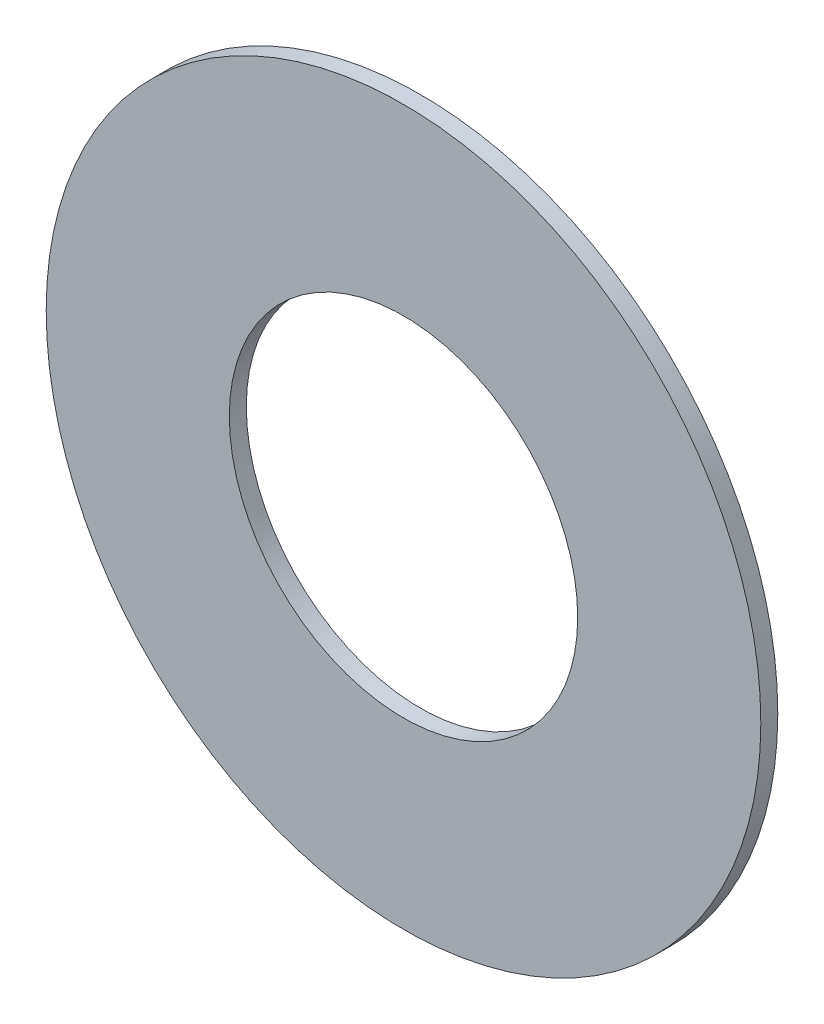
ISO-10303-21;
HEADER;
FILE_DESCRIPTION(('STEP AP214'),'2;1');
FILE_NAME('part.step','',(''),(''),'','','');
FILE_SCHEMA(('AUTOMOTIVE_DESIGN { 1 0 10303 214 1 1 1 1 }'));
ENDSEC;
DATA;
#1=APPLICATION_CONTEXT('core data for automotive mechanical design processes');
#2=APPLICATION_PROTOCOL_DEFINITION('international standard','automotive_design',2000,#1);
#3=PRODUCT_CONTEXT('',#1,'mechanical');
#4=PRODUCT('Part','Part','',(#3));
#5=PRODUCT_RELATED_PRODUCT_CATEGORY('part','',(#4));
#6=PRODUCT_DEFINITION_FORMATION('','',#4);
#7=PRODUCT_DEFINITION_CONTEXT('part definition',#1,'design');
#8=PRODUCT_DEFINITION('design','',#6,#7);
#9=PRODUCT_DEFINITION_SHAPE('','',#8);
#10=(LENGTH_UNIT() NAMED_UNIT(*) SI_UNIT(.MILLI.,.METRE.));
#11=(NAMED_UNIT(*) PLANE_ANGLE_UNIT() SI_UNIT($,.RADIAN.));
#12=(NAMED_UNIT(*) SI_UNIT($,.STERADIAN.) SOLID_ANGLE_UNIT());
#13=UNCERTAINTY_MEASURE_WITH_UNIT(LENGTH_MEASURE(1.E-05),#10,'distance_accuracy_value','');
#14=(GEOMETRIC_REPRESENTATION_CONTEXT(3) GLOBAL_UNCERTAINTY_ASSIGNED_CONTEXT((#13)) GLOBAL_UNIT_ASSIGNED_CONTEXT((#10,
#11,#12)) REPRESENTATION_CONTEXT('',''));
#15=CARTESIAN_POINT('',(0.,0.,0.));
#16=DIRECTION('',(0.,0.,1.));
#17=DIRECTION('',(1.,0.,0.));
#18=AXIS2_PLACEMENT_3D('',#15,#16,#17);
#19=CARTESIAN_POINT('',(0.,0.,2.413));
#20=DIRECTION('',(0.,0.,-1.));
#21=DIRECTION('',(-1.,0.,0.));
#22=AXIS2_PLACEMENT_3D('',#19,#20,#21);
#23=CYLINDRICAL_SURFACE('',#22,50.8);
#24=CARTESIAN_POINT('',(0.,0.,2.413));
#25=DIRECTION('',(0.,0.,1.));
#26=DIRECTION('',(1.,0.,0.));
#27=AXIS2_PLACEMENT_3D('',#24,#25,#26);
#28=CIRCLE('',#27,50.8);
#29=CARTESIAN_POINT('',(50.8,0.,2.413));
#30=VERTEX_POINT('',#29);
#31=EDGE_CURVE('E10',#30,#30,#28,.T.);
#32=ORIENTED_EDGE('',*,*,#31,.F.);
#33=EDGE_LOOP('',(#32));
#34=FACE_BOUND('',#33,.T.);
#35=CARTESIAN_POINT('',(0.,0.,0.));
#36=DIRECTION('',(0.,0.,1.));
#37=DIRECTION('',(1.,0.,0.));
#38=AXIS2_PLACEMENT_3D('',#35,#36,#37);
#39=CIRCLE('',#38,50.8);
#40=CARTESIAN_POINT('',(50.8,0.,0.));
#41=VERTEX_POINT('',#40);
#42=EDGE_CURVE('E33',#41,#41,#39,.T.);
#43=ORIENTED_EDGE('',*,*,#42,.T.);
#44=EDGE_LOOP('',(#43));
#45=FACE_BOUND('',#44,.T.);
#46=ADVANCED_FACE('F30',(#34,#45),#23,.T.);
#47=CARTESIAN_POINT('',(0.,0.,2.413));
#48=DIRECTION('',(0.,0.,1.));
#49=DIRECTION('',(1.,0.,0.));
#50=AXIS2_PLACEMENT_3D('',#47,#48,#49);
#51=PLANE('',#50);
#52=CARTESIAN_POINT('',(0.,0.,2.413));
#53=DIRECTION('',(0.,0.,1.));
#54=DIRECTION('',(1.,0.,0.));
#55=AXIS2_PLACEMENT_3D('',#52,#53,#54);
#56=CIRCLE('',#55,24.765);
#57=CARTESIAN_POINT('',(24.765,0.,2.413));
#58=VERTEX_POINT('',#57);
#59=EDGE_CURVE('E42',#58,#58,#56,.T.);
#60=ORIENTED_EDGE('',*,*,#59,.F.);
#61=EDGE_LOOP('',(#60));
#62=FACE_BOUND('',#61,.T.);
#63=ORIENTED_EDGE('',*,*,#31,.T.);
#64=EDGE_LOOP('',(#63));
#65=FACE_BOUND('',#64,.T.);
#66=ADVANCED_FACE('F57',(#62,#65),#51,.T.);
#67=CARTESIAN_POINT('',(0.,0.,0.));
#68=DIRECTION('',(0.,0.,1.));
#69=DIRECTION('',(1.,0.,0.));
#70=AXIS2_PLACEMENT_3D('',#67,#68,#69);
#71=PLANE('',#70);
#72=CARTESIAN_POINT('',(0.,0.,0.));
#73=DIRECTION('',(0.,0.,1.));
#74=DIRECTION('',(1.,0.,0.));
#75=AXIS2_PLACEMENT_3D('',#72,#73,#74);
#76=CIRCLE('',#75,24.765);
#77=CARTESIAN_POINT('',(24.765,0.,0.));
#78=VERTEX_POINT('',#77);
#79=EDGE_CURVE('E40',#78,#78,#76,.T.);
#80=ORIENTED_EDGE('',*,*,#79,.T.);
#81=EDGE_LOOP('',(#80));
#82=FACE_BOUND('',#81,.T.);
#83=ORIENTED_EDGE('',*,*,#42,.F.);
#84=EDGE_LOOP('',(#83));
#85=FACE_BOUND('',#84,.T.);
#86=ADVANCED_FACE('F48',(#82,#85),#71,.F.);
#87=CARTESIAN_POINT('',(0.,0.,0.));
#88=DIRECTION('',(0.,0.,1.));
#89=DIRECTION('',(1.,0.,0.));
#90=AXIS2_PLACEMENT_3D('',#87,#88,#89);
#91=CYLINDRICAL_SURFACE('',#90,24.765);
#92=ORIENTED_EDGE('',*,*,#79,.F.);
#93=EDGE_LOOP('',(#92));
#94=FACE_BOUND('',#93,.T.);
#95=ORIENTED_EDGE('',*,*,#59,.T.);
#96=EDGE_LOOP('',(#95));
#97=FACE_BOUND('',#96,.T.);
#98=ADVANCED_FACE('F51',(#94,#97),#91,.F.);
#99=CLOSED_SHELL('',(#46,#66,#86,#98));
#100=MANIFOLD_SOLID_BREP('B2',#99);
#101=ADVANCED_BREP_SHAPE_REPRESENTATION('',(#18,#100),#14);
#102=SHAPE_DEFINITION_REPRESENTATION(#9,#101);
ENDSEC;
END-ISO-10303-21;
